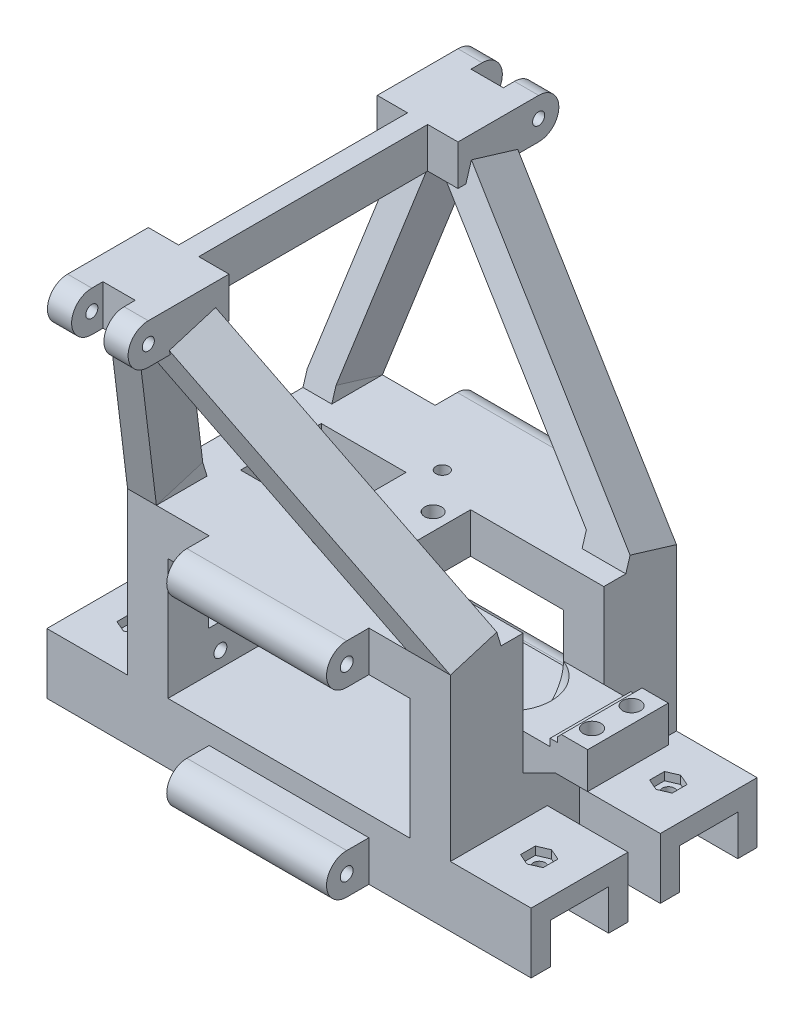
from build123d import *

# Parameters (mm, degrees)
SKETCH_1_W            = 10
SKETCH_1_H            = 35
EXTRUDE_3_DEPTH       = 6
SKETCH_1_5_W          = 19.8
SKETCH_1_5_H          = 10
EXTRUDE_4_DEPTH       = 16.5
SKETCH_2_R            = 1.6
CUT_EXTRUDE_1_DEPTH   = 39.6
SKETCH_1_6_W          = 19.8
SKETCH_1_6_H          = 10
SKETCH_1_6_W_2        = 10
SKETCH_1_6_H_2        = 35
EXTRUDE_5_DEPTH       = 40
SKETCH_3_W            = 39.6
SKETCH_3_H            = 10
EXTRUDE_6_DEPTH       = 10.5
SKETCH_4_R            = 1.6
CUT_EXTRUDE_2_DEPTH   = 39.6
EXTRUDE_7_DEPTH       = 12
EXTRUDE_8_REACH       = 114.364
SKETCH_6_W            = 7.136270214
SKETCH_6_H            = 12
SKETCH_6_W_2          = 10.837603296
EXTRUDE_9_DEPTH       = 20
EXTRUDE_9_DEPTH_BACK  = 5
SKETCH_10_W           = 8
SKETCH_10_H           = 7.758717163
CUT_EXTRUDE_10_DEPTH  = 10
SKETCH_9_R            = 1.5
CUT_EXTRUDE_11_DEPTH  = 130.072158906
SKETCH_13_W           = 10
SKETCH_13_H           = 21
CUT_EXTRUDE_6_DEPTH   = 33
SKETCH_14_R           = 2.1
CUT_EXTRUDE_7_DEPTH   = 10
SKETCH_15_W           = 20
SKETCH_15_H           = 5
EXTRUDE_11_DEPTH      = 16
SKETCH_16_W           = 7.5
SKETCH_16_H           = 20
EXTRUDE_12_DEPTH      = 4
SKETCH_17_R           = 2.2
CUT_EXTRUDE_8_DEPTH   = 9
SKETCH_19_W           = 60
SKETCH_19_H           = 56
EXTRUDE_13_DEPTH      = 5
SKETCH_18_W           = 14.4
SKETCH_18_H           = 10
CUT_EXTRUDE_9_DEPTH   = 142.736982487
EXTRUDE_14_DEPTH      = 20
EXTRUDE_14_DEPTH_BACK = 100
SKETCH_18_5_W         = 4.8
SKETCH_18_5_H         = 10
SKETCH_11_W           = 2.5
SKETCH_11_H           = 56.730774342
EXTRUDE_15_DEPTH      = 10
SKETCH_20_R           = 1.5
CUT_EXTRUDE_12_DEPTH  = 5
SKETCH_20_3_R         = 1.5
CUT_EXTRUDE_13_DEPTH  = 2
CUT_EXTRUDE_14_DEPTH  = 2.5
SKETCH_24_R           = 1.6
CUT_EXTRUDE_15_DEPTH  = 10
SKETCH_25_R           = 1.6
CUT_EXTRUDE_16_DEPTH  = 10
SKETCH_26_W           = 18
SKETCH_26_H           = 20
CUT_EXTRUDE_17_DEPTH  = 10
CHAMFER_1_SIZE        = 1
SKETCH_28_W           = 1.8
SKETCH_28_H           = 1.8
EXTRUDE_16_DEPTH      = 20
SKETCH_30_W           = 21
SKETCH_30_H           = 20
CUT_EXTRUDE_18_DEPTH  = 10


with BuildPart() as part:
    # Sketch 1 → Extrude 3 (new body)
    with BuildSketch(Plane.XY):
        with Locations((-7.633778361, 10.555029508)):
            Rectangle(SKETCH_1_W, SKETCH_1_H)
        Polygon((-22.833778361, 38.055029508), (-22.833778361, 28.055029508), (-12.633778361, 28.055029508), (-2.633778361, 28.055029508), (-2.633778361, 38.055029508), align=None)
        Polygon((-12.633778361, -6.944970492), (-22.833778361, -6.944970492), (-22.833778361, -16.944970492), (-2.633778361, -16.944970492), (-2.633778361, -6.944970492), align=None)
        Polygon((-62.433778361, -6.944970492), (-72.633778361, -6.944970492), (-82.633778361, -6.944970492), (-82.633778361, -16.944970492), (-62.433778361, -16.944970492), align=None)
        with Locations((-77.633778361, 10.555029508)):
            Rectangle(SKETCH_1_W, SKETCH_1_H)
        Polygon((-82.633778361, 28.055029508), (-72.633778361, 28.055029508), (-62.433778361, 28.055029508), (-62.433778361, 38.055029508), (-82.633778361, 38.055029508), align=None)
    extrude(amount=EXTRUDE_3_DEPTH)

    # Sketch 1_5 → Extrude 4 (add)
    with BuildSketch(Plane.XY):
        with Locations((-52.533778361, 33.055029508)):
            Rectangle(SKETCH_1_5_W, SKETCH_1_5_H)
        with Locations((-32.733778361, 33.055029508)):
            Rectangle(SKETCH_1_5_W, SKETCH_1_5_H)
        with Locations((-52.533778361, -11.944970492)):
            Rectangle(SKETCH_1_5_W, SKETCH_1_5_H)
        with Locations((-32.733778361, -11.944970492)):
            Rectangle(SKETCH_1_5_W, SKETCH_1_5_H)
    extrude(amount=EXTRUDE_4_DEPTH)

    # Sketch 2 → Cut-Extrude 1 (cut)
    with BuildSketch(Plane(origin=(-22.833778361, 0, 0), x_dir=(0, 0, -1), z_dir=(1, 0, 0))):
        with Locations((-11.5, 33.055029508)):
            Circle(SKETCH_2_R)
        with BuildLine():
            Line((-16.5, 38.055029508), (-16.5, 33.055029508))
            ThreePointArc((-16.5, 33.055029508), (-15.035533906, 36.590563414), (-11.5, 38.055029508))
            Line((-11.5, 38.055029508), (-16.5, 38.055029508))
        make_face()
        with BuildLine():
            Line((-16.5, 33.055029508), (-16.5, 28.055029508))
            Line((-16.5, 28.055029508), (-11.5, 28.055029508))
            ThreePointArc((-11.5, 28.055029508), (-15.035533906, 29.519495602), (-16.5, 33.055029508))
        make_face()
        with Locations((-11.5, -11.944970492)):
            Circle(SKETCH_2_R)
        with BuildLine():
            Line((-16.5, -6.944970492), (-16.5, -11.944970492))
            ThreePointArc((-16.5, -11.944970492), (-15.035533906, -8.409436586), (-11.5, -6.944970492))
            Line((-11.5, -6.944970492), (-16.5, -6.944970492))
        make_face()
        with BuildLine():
            Line((-16.5, -11.944970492), (-16.5, -16.944970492))
            Line((-16.5, -16.944970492), (-11.5, -16.944970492))
            ThreePointArc((-11.5, -16.944970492), (-15.035533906, -15.480504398), (-16.5, -11.944970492))
        make_face()
    extrude(amount=-CUT_EXTRUDE_1_DEPTH, mode=Mode.SUBTRACT)

    # Sketch 1_6 → Extrude 5 (add)
    with BuildSketch(Plane.XY):
        Polygon((-22.833778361, 38.055029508), (-22.833778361, 28.055029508), (-12.633778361, 28.055029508), (-2.633778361, 28.055029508), (-2.633778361, 38.055029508), align=None)
        with Locations((-32.733778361, 33.055029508)):
            Rectangle(SKETCH_1_6_W, SKETCH_1_6_H)
        with Locations((-52.533778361, 33.055029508)):
            Rectangle(SKETCH_1_6_W, SKETCH_1_6_H)
        Polygon((-82.633778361, 28.055029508), (-72.633778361, 28.055029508), (-62.433778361, 28.055029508), (-62.433778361, 38.055029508), (-82.633778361, 38.055029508), align=None)
        with Locations((-77.633778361, 10.555029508)):
            Rectangle(SKETCH_1_6_W_2, SKETCH_1_6_H_2)
        Polygon((-62.433778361, -6.944970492), (-72.633778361, -6.944970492), (-82.633778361, -6.944970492), (-82.633778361, -16.944970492), (-62.433778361, -16.944970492), align=None)
        with Locations((-52.533778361, -11.944970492)):
            Rectangle(SKETCH_1_6_W, SKETCH_1_6_H)
        Polygon((-12.633778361, -6.944970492), (-22.833778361, -6.944970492), (-22.833778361, -16.944970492), (-2.633778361, -16.944970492), (-2.633778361, -6.944970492), align=None)
        with Locations((-7.633778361, 10.555029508)):
            Rectangle(SKETCH_1_6_W_2, SKETCH_1_6_H_2)
        with Locations((-32.733778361, -11.944970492)):
            Rectangle(SKETCH_1_6_W, SKETCH_1_6_H)
    extrude(amount=-EXTRUDE_5_DEPTH)

    # Sketch 3 → Extrude 6 (add)
    with BuildSketch(Plane(origin=(0, 0, -40), x_dir=(-1, 0, 0), z_dir=(0, 0, -1))):
        with Locations((42.633778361, 33.055029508)):
            Rectangle(SKETCH_3_W, SKETCH_3_H)
        with Locations((42.633778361, -11.944970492)):
            Rectangle(SKETCH_3_W, SKETCH_3_H)
    extrude(amount=EXTRUDE_6_DEPTH)

    # Sketch 4 → Cut-Extrude 2 (cut)
    with BuildSketch(Plane(origin=(-22.833778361, 0, 0), x_dir=(0, 0, -1), z_dir=(1, 0, 0))):
        with BuildLine():
            Line((50.5, 38.055029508), (45.5, 38.055029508))
            ThreePointArc((45.5, 38.055029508), (49.035533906, 36.590563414), (50.5, 33.055029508))
            Line((50.5, 33.055029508), (50.5, 38.055029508))
        make_face()
        with Locations((45.5, 33.055029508)):
            Circle(SKETCH_4_R)
        with BuildLine():
            ThreePointArc((50.5, 33.055029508), (49.035533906, 29.519495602), (45.5, 28.055029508))
            Line((45.5, 28.055029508), (50.5, 28.055029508))
            Line((50.5, 28.055029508), (50.5, 33.055029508))
        make_face()
        with BuildLine():
            ThreePointArc((50.5, -11.944970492), (49.035533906, -15.480504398), (45.5, -16.944970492))
            Line((45.5, -16.944970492), (50.5, -16.944970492))
            Line((50.5, -16.944970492), (50.5, -11.944970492))
        make_face()
        with BuildLine():
            Line((50.5, -6.944970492), (45.5, -6.944970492))
            ThreePointArc((45.5, -6.944970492), (49.035533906, -8.409436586), (50.5, -11.944970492))
            Line((50.5, -11.944970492), (50.5, -6.944970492))
        make_face()
        with Locations((45.5, -11.944970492)):
            Circle(SKETCH_4_R)
    extrude(amount=-CUT_EXTRUDE_2_DEPTH, mode=Mode.SUBTRACT)

    # Extrude 8: up to this face of the body (flat: up to its plane)
    extrude_8_end = Plane(part.part.faces().sort_by_distance((-42.633778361, 38.055029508, -17))[0])
    # Sketch 6 → Extrude 8 (add, up to the picked face)
    with BuildSketch(Plane(origin=(0, 45.962215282, -13.952833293), x_dir=(1, 0, 0), z_dir=(0, -0.9568804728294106, 0.290481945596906)), mode=Mode.PRIVATE) as extrude_8_sk1:
        with Locations((-79.065643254, -21.220919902)):
            Rectangle(SKETCH_6_W, SKETCH_6_H)
    extrude_8_tool1 = split(extrude(extrude_8_sk1.sketch, amount=EXTRUDE_8_REACH, mode=Mode.PRIVATE), bisect_by=extrude_8_end, keep=Keep.BOTH, mode=Mode.PRIVATE)
    # Sketch 6 → Extrude 8 (add, up to the picked face)
    with BuildSketch(Plane(origin=(0, 45.962215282, -13.952833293), x_dir=(1, 0, 0), z_dir=(0, -0.9568804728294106, 0.290481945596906)), mode=Mode.PRIVATE) as extrude_8_sk2:
        with Locations((-8.052580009, -21.220919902)):
            Rectangle(SKETCH_6_W_2, SKETCH_6_H)
    extrude_8_tool2 = split(extrude(extrude_8_sk2.sketch, amount=EXTRUDE_8_REACH, mode=Mode.PRIVATE), bisect_by=extrude_8_end, keep=Keep.BOTH, mode=Mode.PRIVATE)


with BuildPart() as body_2:
    # Sketch 5 → Extrude 7 (new body)
    with BuildSketch(Plane(origin=(0, -7.907185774, -26.047166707), x_dir=(1, 0, 0), z_dir=(0, 0.290481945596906, 0.9568804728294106))):
        Polygon((-71.133778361, 106.033392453), (-82.633778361, 48.033392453), (-75.497508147, 48.033392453), (-65.590557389, 97.998883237), (-13.471381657, 48.033392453), (-2.633778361, 48.033392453), (-63.133778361, 106.033392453), align=None)
    extrude(amount=EXTRUDE_7_DEPTH)


with BuildPart() as part_1:
    add(part.part)

    add(body_2.part)  # Extrude 8 merges body 2
    add(extrude_8_tool1.solids().sort_by(Axis((-79.065643, 39.797921, -34.258717), (0, -0.9568804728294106, 0.290481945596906)))[0])
    add(extrude_8_tool2.solids().sort_by(Axis((-8.05258, 39.797921, -34.258717), (0, -0.9568804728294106, 0.290481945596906)))[0])

    # Sketch 7 → Extrude 9 (add, two sides: drawn at the far end of the back side and taken through both)
    with BuildSketch(Plane(origin=(0, 0, -45.365387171), x_dir=(-1, 0, 0), z_dir=(0, 0, -1)).offset(-EXTRUDE_9_DEPTH_BACK)):
        Polygon((71.133778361, 97.039880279), (63.133778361, 97.039880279), (57.133778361, 97.039880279), (57.133778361, 87.039880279), (77.133778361, 87.039880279), (77.133778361, 97.039880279), align=None)
    extrude(amount=EXTRUDE_9_DEPTH + EXTRUDE_9_DEPTH_BACK)

    # Sketch 10 → Cut-Extrude 10 (cut)
    with BuildSketch(Plane(origin=(0, 97.039880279, 0), x_dir=(1, 0, 0), z_dir=(0, 1, 0))):
        with Locations((-67.133778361, 61.48602859)):
            Rectangle(SKETCH_10_W, SKETCH_10_H)
    extrude(amount=-CUT_EXTRUDE_10_DEPTH, mode=Mode.SUBTRACT)

    # Sketch 9 → Cut-Extrude 11 (cut, through all)
    with BuildSketch(Plane(origin=(-57.133778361, 0, 0), x_dir=(0, 0, -1), z_dir=(1, 0, 0))):
        with BuildLine():
            Line((65.365387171, 97.039880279), (60.365387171, 97.039880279))
            ThreePointArc((60.365387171, 97.039880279), (63.900921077, 95.575414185), (65.365387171, 92.039880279))
            Line((65.365387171, 92.039880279), (65.365387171, 97.039880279))
        make_face()
        with BuildLine():
            Line((65.365387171, 87.039880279), (65.365387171, 92.039880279))
            ThreePointArc((65.365387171, 92.039880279), (63.900921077, 88.504346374), (60.365387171, 87.039880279))
            Line((60.365387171, 87.039880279), (65.365387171, 87.039880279))
        make_face()
        with Locations((60.365387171, 92.039880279)):
            Circle(SKETCH_9_R)
    extrude(amount=-CUT_EXTRUDE_11_DEPTH, mode=Mode.SUBTRACT)

    # Mirror 24: part across plane


with BuildPart() as part_2:
    add(part_1.part)
    add(part_1.part.mirror(Plane.XY.offset(-12)))

    # Sketch 13 → Cut-Extrude 6 (cut)
    with BuildSketch(Plane(origin=(-2.633778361, 0, 0), x_dir=(0, 0, -1), z_dir=(1, 0, 0))):
        with Locations((7, 27.555029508)):
            Rectangle(SKETCH_13_W, SKETCH_13_H)
        with Locations((17, 27.555029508)):
            Rectangle(SKETCH_13_W, SKETCH_13_H)
    extrude(amount=-CUT_EXTRUDE_6_DEPTH, mode=Mode.SUBTRACT)

    # Sketch 14 → Cut-Extrude 7 (cut)
    with BuildSketch(Plane(origin=(0, 38.055029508, 0), x_dir=(1, 0, 0), z_dir=(0, 1, 0))):
        with Locations(Location((-39.833778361, 16.9, 0), (0, 0, 270))):
            Circle(SKETCH_14_R)
        with Locations(Location((-39.833778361, 7.1, 0), (0, 0, 270))):
            Circle(SKETCH_14_R)
    extrude(amount=-CUT_EXTRUDE_7_DEPTH, mode=Mode.SUBTRACT)

    # Sketch 15 → Extrude 11 (add)
    with BuildSketch(Plane(origin=(-2.633778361, 0, 0), x_dir=(0, 0, -1), z_dir=(1, 0, 0))):
        with Locations((12, 14.555029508)):
            Rectangle(SKETCH_15_W, SKETCH_15_H)
    extrude(amount=EXTRUDE_11_DEPTH)

    # Sketch 16 → Extrude 12 (add)
    with BuildSketch(Plane(origin=(0, 17.055029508, 0), x_dir=(1, 0, 0), z_dir=(0, 1, 0))):
        with Locations((9.616221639, 12)):
            Rectangle(SKETCH_16_W, SKETCH_16_H)
    extrude(amount=EXTRUDE_12_DEPTH)

    # Sketch 17 → Cut-Extrude 8 (cut)
    with BuildSketch(Plane(origin=(0, 21.055029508, 0), x_dir=(1, 0, 0), z_dir=(0, 1, 0))):
        with Locations(Location((9.366221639, 16.9, 0), (0, 0, 270))):
            Circle(SKETCH_17_R)
        with Locations(Location((9.366221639, 7.1, 0), (0, 0, 270))):
            Circle(SKETCH_17_R)
    extrude(amount=-CUT_EXTRUDE_8_DEPTH, mode=Mode.SUBTRACT)

    # Sketch 19 → Extrude 13 (add)
    with BuildSketch(Plane(origin=(0, -6.944970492, 0), x_dir=(1, 0, 0), z_dir=(0, 1, 0))):
        with Locations((-42.633778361, 12)):
            Rectangle(SKETCH_19_W, SKETCH_19_H)
    extrude(amount=EXTRUDE_13_DEPTH)

    # Sketch 18 → Cut-Extrude 9 (cut, through all)
    with BuildSketch(Plane(origin=(-2.633778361, 0, 0), x_dir=(0, 0, -1), z_dir=(1, 0, 0))):
        with Locations((-4, -11.944970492)):
            Rectangle(SKETCH_18_W, SKETCH_18_H)
        with Locations((28, -11.944970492)):
            Rectangle(SKETCH_18_W, SKETCH_18_H)
    extrude(amount=-CUT_EXTRUDE_9_DEPTH, mode=Mode.SUBTRACT)

    # Sketch 18_5 → Extrude 14 (add, two sides: drawn at the far end of the back side and taken through both)
    with BuildSketch(Plane(origin=(-2.633778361, 0, 0), x_dir=(0, 0, -1), z_dir=(1, 0, 0)).offset(-EXTRUDE_14_DEPTH_BACK)):
        Polygon((-16, -1.944970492), (-16, -6.944970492), (-11.2, -6.944970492), (3.2, -6.944970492), (8, -6.944970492), (8, -1.944970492), align=None)
        with Locations((-13.6, -11.944970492)):
            Rectangle(SKETCH_18_5_W, SKETCH_18_5_H)
        with Locations((5.6, -11.944970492)):
            Rectangle(SKETCH_18_5_W, SKETCH_18_5_H)
        Polygon((40, -1.944970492), (16, -1.944970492), (16, -6.944970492), (20.8, -6.944970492), (35.2, -6.944970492), (40, -6.944970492), align=None)
        with Locations((18.4, -11.944970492)):
            Rectangle(SKETCH_18_5_W, SKETCH_18_5_H)
        with Locations((37.6, -11.944970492)):
            Rectangle(SKETCH_18_5_W, SKETCH_18_5_H)
    extrude(amount=EXTRUDE_14_DEPTH + EXTRUDE_14_DEPTH_BACK)

    # Sketch 11 → Extrude 15 (add)
    with BuildSketch(Plane(origin=(0, 97.039880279, 0), x_dir=(1, 0, 0), z_dir=(0, 1, 0))):
        with Locations((-65.883778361, 12)):
            Rectangle(SKETCH_11_W, SKETCH_11_H)
        with Locations((-68.383778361, 12)):
            Rectangle(SKETCH_11_W, SKETCH_11_H)
    extrude(amount=-EXTRUDE_15_DEPTH)

    # Sketch 20 → Cut-Extrude 12 (cut)
    with BuildSketch(Plane(origin=(0, -1.944970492, 0), x_dir=(1, 0, 0), z_dir=(0, 1, 0))):
        with Locations(Location((7.366221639, -4, 0), (0, 0, 270))):
            Circle(SKETCH_20_R)
        with Locations(Location((7.366221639, 28, 0), (0, 0, 270))):
            Circle(SKETCH_20_R)
        with Locations(Location((-92.633778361, 28, 0), (0, 0, 270))):
            Circle(SKETCH_20_R)
        with Locations(Location((-92.633778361, -4, 0), (0, 0, 270))):
            Circle(SKETCH_20_R)
    extrude(amount=-CUT_EXTRUDE_12_DEPTH, mode=Mode.SUBTRACT)

    # Sketch 20_3 → Cut-Extrude 13 (cut)
    # profile 1 of 4: a face of its own
    with BuildSketch(Plane(origin=(0, -1.944970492, 0), x_dir=(1, 0, 0), z_dir=(0, 1, 0))):
        Polygon((4.566221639, -2.159338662), (7.366221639, -0.95), (10.166221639, -2.159338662), (10.166221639, -5.840661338), (7.366221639, -7.05), (4.566221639, -5.840661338), align=None)
        with Locations(Location((7.366221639, -4, 0), (0, 0, 270))):
            Circle(SKETCH_20_3_R, mode=Mode.SUBTRACT)
    # profile 2 of 4: a face of its own
    with BuildSketch(Plane(origin=(0, -1.944970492, 0), x_dir=(1, 0, 0), z_dir=(0, 1, 0))):
        Polygon((4.566221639, 29.840661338), (7.366221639, 31.05), (10.166221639, 29.840661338), (10.166221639, 26.159338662), (7.366221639, 24.95), (4.566221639, 26.159338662), align=None)
        with Locations(Location((7.366221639, 28, 0), (0, 0, 270))):
            Circle(SKETCH_20_3_R, mode=Mode.SUBTRACT)
    # profile 3 of 4: a face of its own
    with BuildSketch(Plane(origin=(0, -1.944970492, 0), x_dir=(1, 0, 0), z_dir=(0, 1, 0))):
        Polygon((-95.433778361, 29.840661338), (-92.633778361, 31.05), (-89.833778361, 29.840661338), (-89.833778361, 26.159338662), (-92.633778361, 24.95), (-95.433778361, 26.159338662), align=None)
        with Locations(Location((-92.633778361, 28, 0), (0, 0, 270))):
            Circle(SKETCH_20_3_R, mode=Mode.SUBTRACT)
    # profile 4 of 4: a face of its own
    with BuildSketch(Plane(origin=(0, -1.944970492, 0), x_dir=(1, 0, 0), z_dir=(0, 1, 0))):
        Polygon((-95.433778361, -2.159338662), (-92.633778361, -0.95), (-89.833778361, -2.159338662), (-89.833778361, -5.840661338), (-92.633778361, -7.05), (-95.433778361, -5.840661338), align=None)
        with Locations(Location((-92.633778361, -4, 0), (0, 0, 270))):
            Circle(SKETCH_20_3_R, mode=Mode.SUBTRACT)
    extrude(amount=-CUT_EXTRUDE_13_DEPTH, mode=Mode.SUBTRACT)

    # Sketch 21 → Cut-Extrude 14 (cut)
    with BuildSketch(Plane.XZ.offset(-12.055029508)):
        Polygon((9.366221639, -13.470110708), (12.616221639, -14.566304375), (12.616221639, -19.233695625), (9.059376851, -20.433385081), (6.116221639, -18.831045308), (6.116221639, -14.566304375), align=None)
        Polygon((12.616221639, -4.766304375), (12.616221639, -9.433695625), (9.059376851, -10.633385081), (6.116221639, -9.031045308), (6.116221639, -4.766304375), (9.366221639, -3.670110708), align=None)
    extrude(amount=-CUT_EXTRUDE_14_DEPTH, mode=Mode.SUBTRACT)

    # Sketch 24 → Cut-Extrude 15 (cut)
    with BuildSketch(Plane.XZ.offset(-28.055029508)):
        with Locations(Location((-47.633778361, 3, 0), (0, 0, 270))):
            Circle(SKETCH_24_R)
        with Locations(Location((-47.633778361, -27, 0), (0, 0, 270))):
            Circle(SKETCH_24_R)
    extrude(amount=-CUT_EXTRUDE_15_DEPTH, mode=Mode.SUBTRACT)

    # Sketch 25 → Cut-Extrude 16 (cut)
    with BuildSketch(Plane(origin=(-72.633778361, 0, 0), x_dir=(0, 0, -1), z_dir=(1, 0, 0))):
        with Locations((-3, 1.855029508)):
            Circle(SKETCH_25_R)
        with Locations((27, 1.855029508)):
            Circle(SKETCH_25_R)
    extrude(amount=-CUT_EXTRUDE_16_DEPTH, mode=Mode.SUBTRACT)

    # Sketch 26 → Cut-Extrude 17 (cut)
    with BuildSketch(Plane.ZY.offset(82.633778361)):
        with Locations((-21, 18.055029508)):
            Rectangle(SKETCH_26_W, SKETCH_26_H)
        with Locations((-3, 18.055029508)):
            Rectangle(SKETCH_26_W, SKETCH_26_H)
    extrude(amount=-CUT_EXTRUDE_17_DEPTH, mode=Mode.SUBTRACT)

    # Chamfer 1
    chamfer_1_edges = [part_2.edges().sort_by_distance(p)[0] for p in [
        (5.866221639, 21.055029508, -12),
    ]]
    chamfer(chamfer_1_edges, length=CHAMFER_1_SIZE)

    # Sketch 28 → Extrude 16 (add)
    with BuildSketch(Plane.XY.offset(-2)):
        with Locations((4.966221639, 17.955029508)):
            Rectangle(SKETCH_28_W, SKETCH_28_H)
        Polygon((5.366221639, 12.055029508), (-2.633778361, 12.055029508), (-2.633778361, 8.055029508), align=None)
    extrude(amount=-EXTRUDE_16_DEPTH)

    # Sketch 29 one side → Cut-Revolve 1 (revolve, cut)
    with BuildSketch(Plane(origin=(0, 17.055029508, 0), x_dir=(1, 0, 0), z_dir=(0, 1, 0))):
        with BuildLine():
            Line((-16.276635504, 1.357142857), (-16.276635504, 22.642857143))
            ThreePointArc((-16.276635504, 22.642857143), (-26.919492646, 12), (-16.276635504, 1.357142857))
        make_face()
    revolve(axis=Axis((-16.276635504, 17.055029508, -12), (0, 0, -1)), mode=Mode.SUBTRACT)

    # Sketch 30 → Cut-Extrude 18 (cut)
    with BuildSketch(Plane(origin=(0, 38.055029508, 0), x_dir=(1, 0, 0), z_dir=(0, 1, 0))):
        with Locations((-62.133778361, 12)):
            Rectangle(SKETCH_30_W, SKETCH_30_H)
    extrude(amount=-CUT_EXTRUDE_18_DEPTH, mode=Mode.SUBTRACT)


solid = part_2.part
